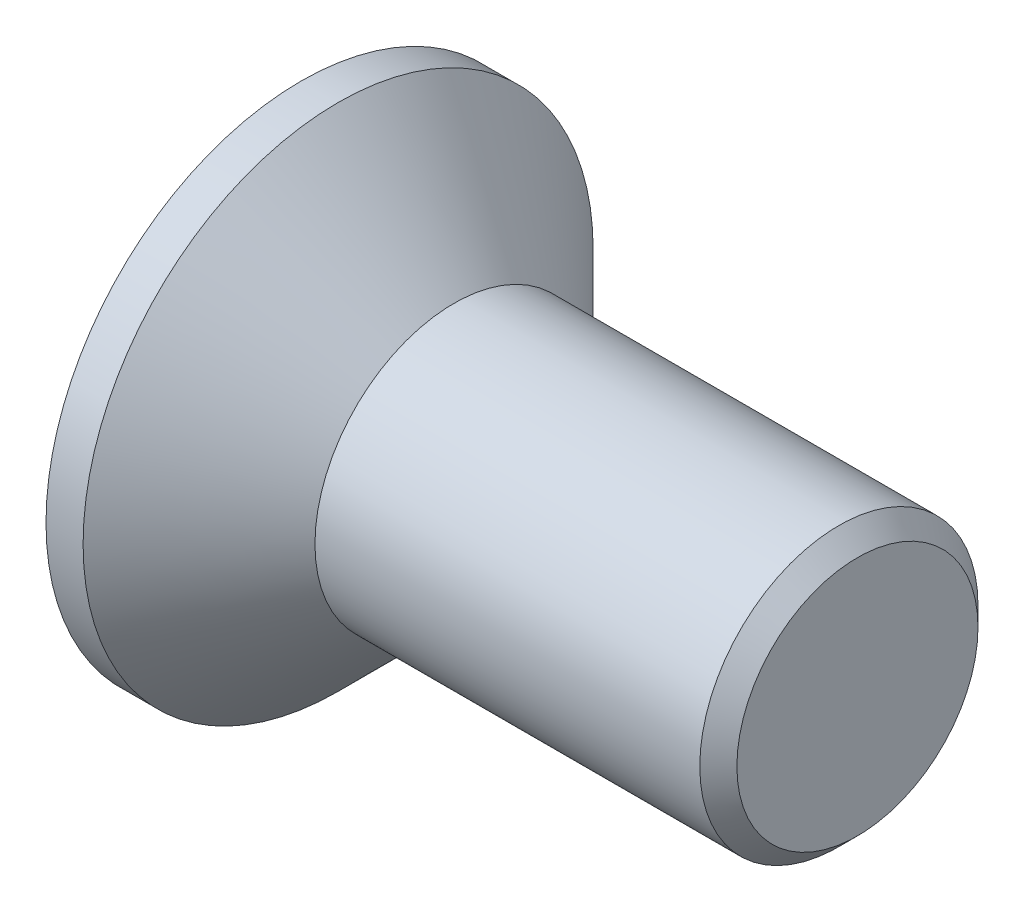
ISO-10303-21;
HEADER;
FILE_DESCRIPTION(('STEP AP214'),'2;1');
FILE_NAME('part.step','',(''),(''),'','','');
FILE_SCHEMA(('AUTOMOTIVE_DESIGN { 1 0 10303 214 1 1 1 1 }'));
ENDSEC;
DATA;
#1=APPLICATION_CONTEXT('core data for automotive mechanical design processes');
#2=APPLICATION_PROTOCOL_DEFINITION('international standard','automotive_design',2000,#1);
#3=PRODUCT_CONTEXT('',#1,'mechanical');
#4=PRODUCT('Part','Part','',(#3));
#5=PRODUCT_RELATED_PRODUCT_CATEGORY('part','',(#4));
#6=PRODUCT_DEFINITION_FORMATION('','',#4);
#7=PRODUCT_DEFINITION_CONTEXT('part definition',#1,'design');
#8=PRODUCT_DEFINITION('design','',#6,#7);
#9=PRODUCT_DEFINITION_SHAPE('','',#8);
#10=(LENGTH_UNIT() NAMED_UNIT(*) SI_UNIT(.MILLI.,.METRE.));
#11=(NAMED_UNIT(*) PLANE_ANGLE_UNIT() SI_UNIT($,.RADIAN.));
#12=(NAMED_UNIT(*) SI_UNIT($,.STERADIAN.) SOLID_ANGLE_UNIT());
#13=UNCERTAINTY_MEASURE_WITH_UNIT(LENGTH_MEASURE(1.E-05),#10,'distance_accuracy_value','');
#14=(GEOMETRIC_REPRESENTATION_CONTEXT(3) GLOBAL_UNCERTAINTY_ASSIGNED_CONTEXT((#13)) GLOBAL_UNIT_ASSIGNED_CONTEXT((#10,
#11,#12)) REPRESENTATION_CONTEXT('',''));
#15=CARTESIAN_POINT('',(0.,0.,0.));
#16=DIRECTION('',(0.,0.,1.));
#17=DIRECTION('',(1.,0.,0.));
#18=AXIS2_PLACEMENT_3D('',#15,#16,#17);
#19=CARTESIAN_POINT('',(0.,0.,0.));
#20=DIRECTION('',(-1.,0.,0.));
#21=DIRECTION('',(0.,0.,1.));
#22=AXIS2_PLACEMENT_3D('',#19,#20,#21);
#23=CONICAL_SURFACE('',#22,1.4,1.30899693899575);
#24=CARTESIAN_POINT('',(0.0494758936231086,1.184412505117,-0.272490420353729));
#25=CARTESIAN_POINT('',(0.0456763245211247,1.19979582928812,-0.268867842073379));
#26=CARTESIAN_POINT('',(0.0420142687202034,1.2148998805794,-0.263909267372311));
#27=CARTESIAN_POINT('',(0.0350324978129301,1.24412757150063,-0.251480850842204));
#28=CARTESIAN_POINT('',(0.0317128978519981,1.25825088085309,-0.244010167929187));
#29=CARTESIAN_POINT('',(0.0254826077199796,1.28509891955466,-0.226711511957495));
#30=CARTESIAN_POINT('',(0.0225723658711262,1.29782211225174,-0.216880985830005));
#31=CARTESIAN_POINT('',(0.0172248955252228,1.32144519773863,-0.195133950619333));
#32=CARTESIAN_POINT('',(0.0147873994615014,1.33234612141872,-0.183218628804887));
#33=CARTESIAN_POINT('',(0.0104748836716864,1.35178781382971,-0.157875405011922));
#34=CARTESIAN_POINT('',(0.00859002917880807,1.36036960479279,-0.144480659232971));
#35=CARTESIAN_POINT('',(0.00535872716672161,1.37516346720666,-0.116377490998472));
#36=CARTESIAN_POINT('',(0.00401233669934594,1.38137528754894,-0.101668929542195));
#37=CARTESIAN_POINT('',(0.00190884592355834,1.39111102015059,-0.0717048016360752));
#38=CARTESIAN_POINT('',(0.00113952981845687,1.39469061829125,-0.0564681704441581));
#39=CARTESIAN_POINT('',(0.000157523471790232,1.39926377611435,-0.0255960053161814));
#40=CARTESIAN_POINT('',(-5.52691749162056E-05,1.40025781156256,-0.00996054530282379));
#41=CARTESIAN_POINT('',(7.8867611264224E-05,1.39963210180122,0.0210654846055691));
#42=CARTESIAN_POINT('',(0.00041905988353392,1.39804381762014,0.0364567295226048));
#43=CARTESIAN_POINT('',(0.0016399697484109,1.39236385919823,0.0667488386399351));
#44=CARTESIAN_POINT('',(0.00252072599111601,1.38827200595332,0.0816496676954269));
#45=CARTESIAN_POINT('',(0.00480637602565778,1.37771350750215,0.110546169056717));
#46=CARTESIAN_POINT('',(0.0062114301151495,1.37124613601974,0.124541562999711));
#47=CARTESIAN_POINT('',(0.00951884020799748,1.35614044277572,0.15123791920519));
#48=CARTESIAN_POINT('',(0.0114211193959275,1.34750245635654,0.163939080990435));
#49=CARTESIAN_POINT('',(0.0157139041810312,1.32820010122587,0.187861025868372));
#50=CARTESIAN_POINT('',(0.0181100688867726,1.31751235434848,0.199061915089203));
#51=CARTESIAN_POINT('',(0.0233321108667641,1.2944967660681,0.219518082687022));
#52=CARTESIAN_POINT('',(0.0261582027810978,1.28216810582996,0.228772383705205));
#53=CARTESIAN_POINT('',(0.0322150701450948,1.25611050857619,0.245178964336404));
#54=CARTESIAN_POINT('',(0.0354493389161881,1.24236970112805,0.252311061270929));
#55=CARTESIAN_POINT('',(0.0422380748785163,1.21397728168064,0.26420997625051));
#56=CARTESIAN_POINT('',(0.0457924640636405,1.19932589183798,0.268977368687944));
#57=CARTESIAN_POINT('',(0.0494758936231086,1.184412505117,0.27249042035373));
#58=B_SPLINE_CURVE_WITH_KNOTS('',3,(#24,#25,#26,#27,#28,#29,#30,#31,#32,#33,#34,#35,#36,#37,#38,
#39,#40,#41,#42,#43,#44,#45,#46,#47,#48,#49,#50,#51,#52,#53,#54,#55,#56,#57),.UNSPECIFIED.,.F.,
.F.,(4,2,2,2,2,2,2,2,2,2,2,2,2,2,2,2,4),(0.,0.0487105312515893,0.0974373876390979,
0.146217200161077,0.194969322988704,0.242792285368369,0.290620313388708,0.337404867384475,
0.384180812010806,0.430391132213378,0.476604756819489,0.522832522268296,0.569053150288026,
0.615836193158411,0.662642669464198,0.709881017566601,0.757107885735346),.UNSPECIFIED.);
#59=CARTESIAN_POINT('',(0.,1.4,0.));
#60=VERTEX_POINT('',#59);
#61=CARTESIAN_POINT('',(0.049426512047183,1.18461250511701,0.272443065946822));
#62=VERTEX_POINT('',#61);
#63=EDGE_CURVE('E194',#60,#62,#58,.T.);
#64=ORIENTED_EDGE('',*,*,#63,.T.);
#65=CARTESIAN_POINT('',(0.0493771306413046,1.18481250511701,0.272395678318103));
#66=CARTESIAN_POINT('',(0.0558388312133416,1.15862135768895,0.27857608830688));
#67=CARTESIAN_POINT('',(0.0620203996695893,1.13286680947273,0.28696987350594));
#68=CARTESIAN_POINT('',(0.0735015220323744,1.08287223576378,0.307984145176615));
#69=CARTESIAN_POINT('',(0.0787992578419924,1.0586353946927,0.320613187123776));
#70=CARTESIAN_POINT('',(0.0881709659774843,1.01238532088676,0.349899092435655));
#71=CARTESIAN_POINT('',(0.0922425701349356,0.990376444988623,0.366563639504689));
#72=CARTESIAN_POINT('',(0.0988047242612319,0.949368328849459,0.403479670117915));
#73=CARTESIAN_POINT('',(0.101297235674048,0.930365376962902,0.423726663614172));
#74=CARTESIAN_POINT('',(0.104392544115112,0.896755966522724,0.466271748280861));
#75=CARTESIAN_POINT('',(0.105073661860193,0.881992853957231,0.488440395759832));
#76=CARTESIAN_POINT('',(0.104705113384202,0.856258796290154,0.534864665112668));
#77=CARTESIAN_POINT('',(0.103655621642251,0.845287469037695,0.559120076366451));
#78=CARTESIAN_POINT('',(0.0999930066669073,0.827738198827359,0.608131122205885));
#79=CARTESIAN_POINT('',(0.0974333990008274,0.821025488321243,0.632842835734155));
#80=CARTESIAN_POINT('',(0.0910050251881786,0.811530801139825,0.682858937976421));
#81=CARTESIAN_POINT('',(0.0871352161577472,0.808751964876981,0.708163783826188));
#82=CARTESIAN_POINT('',(0.0781256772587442,0.807082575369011,0.760035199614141));
#83=CARTESIAN_POINT('',(0.072930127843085,0.808402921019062,0.786598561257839));
#84=CARTESIAN_POINT('',(0.0617031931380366,0.815246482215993,0.838965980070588));
#85=CARTESIAN_POINT('',(0.055672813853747,0.820764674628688,0.864770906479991));
#86=CARTESIAN_POINT('',(0.0493763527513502,0.828308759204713,0.889882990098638));
#87=B_SPLINE_CURVE_WITH_KNOTS('',3,(#65,#66,#67,#68,#69,#70,#71,#72,#73,#74,#75,#76,#77,#78,#79,
#80,#81,#82,#83,#84,#85,#86),.UNSPECIFIED.,.F.,.F.,(4,2,2,2,2,2,2,2,2,2,4),(0.,
0.0829614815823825,0.166091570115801,0.249381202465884,0.33256717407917,0.412093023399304,
0.49161085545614,0.568466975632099,0.645384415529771,0.726323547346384,0.807165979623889),.UNSPECIFIED.);
#88=CARTESIAN_POINT('',(0.0494265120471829,0.828248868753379,0.889682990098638));
#89=VERTEX_POINT('',#88);
#90=EDGE_CURVE('E11',#62,#89,#87,.T.);
#91=ORIENTED_EDGE('',*,*,#90,.T.);
#92=CARTESIAN_POINT('',(0.0494766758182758,0.828188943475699,0.889482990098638));
#93=CARTESIAN_POINT('',(0.0456770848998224,0.832743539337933,0.904616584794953));
#94=CARTESIAN_POINT('',(0.0420150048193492,0.836001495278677,0.92017633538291));
#95=CARTESIAN_POINT('',(0.0350331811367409,0.839852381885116,0.951702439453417));
#96=CARTESIAN_POINT('',(0.0317135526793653,0.840444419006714,0.967668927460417));
#97=CARTESIAN_POINT('',(0.0254832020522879,0.838887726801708,0.999569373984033));
#98=CARTESIAN_POINT('',(0.0225729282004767,0.836736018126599,1.01550327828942));
#99=CARTESIAN_POINT('',(0.0172253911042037,0.829714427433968,1.04683508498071));
#100=CARTESIAN_POINT('',(0.0147878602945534,0.824846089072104,1.06223328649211));
#101=CARTESIAN_POINT('',(0.0104752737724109,0.812619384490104,1.09174205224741));
#102=CARTESIAN_POINT('',(0.00859038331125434,0.805310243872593,1.10587156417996));
#103=CARTESIAN_POINT('',(0.00535900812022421,0.788369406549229,1.13273521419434));
#104=CARTESIAN_POINT('',(0.00401258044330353,0.778737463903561,1.1454692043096));
#105=CARTESIAN_POINT('',(0.00190901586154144,0.757655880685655,1.16888290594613));
#106=CARTESIAN_POINT('',(0.00113966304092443,0.746250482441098,1.17960137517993));
#107=CARTESIAN_POINT('',(0.000157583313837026,0.721801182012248,1.19899820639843));
#108=CARTESIAN_POINT('',(-5.52460119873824E-05,0.708757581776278,1.207676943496));
#109=CARTESIAN_POINT('',(7.88185639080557E-05,0.681575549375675,1.22264837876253));
#110=CARTESIAN_POINT('',(0.000418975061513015,0.667452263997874,1.22896866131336));
#111=CARTESIAN_POINT('',(0.00163981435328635,0.638378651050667,1.23919604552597));
#112=CARTESIAN_POINT('',(0.00252053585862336,0.623428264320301,1.24310297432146));
#113=CARTESIAN_POINT('',(0.00480611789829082,0.593123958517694,1.24840762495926));
#114=CARTESIAN_POINT('',(0.0062111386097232,0.57776991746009,1.24980457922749));
#115=CARTESIAN_POINT('',(0.00951848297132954,0.547097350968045,1.25007117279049));
#116=CARTESIAN_POINT('',(0.0114207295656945,0.531778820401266,1.24894120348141));
#117=CARTESIAN_POINT('',(0.015713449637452,0.501410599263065,1.24418617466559));
#118=CARTESIAN_POINT('',(0.018109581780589,0.486366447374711,1.24053092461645));
#119=CARTESIAN_POINT('',(0.0233315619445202,0.457142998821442,1.2308272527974));
#120=CARTESIAN_POINT('',(0.0261576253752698,0.442964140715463,1.22477762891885));
#121=CARTESIAN_POINT('',(0.0322173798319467,0.415713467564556,1.21040769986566));
#122=CARTESIAN_POINT('',(0.0354549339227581,0.402654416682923,1.2020648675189));
#123=CARTESIAN_POINT('',(0.0422508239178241,0.378132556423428,1.18340416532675));
#124=CARTESIAN_POINT('',(0.0458090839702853,0.366669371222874,1.17308676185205));
#125=CARTESIAN_POINT('',(0.0494965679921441,0.356163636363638,1.16191390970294));
#126=B_SPLINE_CURVE_WITH_KNOTS('',3,(#92,#93,#94,#95,#96,#97,#98,#99,#100,#101,#102,#103,#104,
#105,#106,#107,#108,#109,#110,#111,#112,#113,#114,#115,#116,#117,#118,#119,#120,#121,#122,#123,
#124,#125),.UNSPECIFIED.,.F.,.F.,(4,2,2,2,2,2,2,2,2,2,2,2,2,2,2,2,4),(0.,0.0487105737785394,
0.097437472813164,0.146217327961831,0.194969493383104,0.242792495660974,0.290620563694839,
0.33740514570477,0.384181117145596,0.430391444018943,0.476605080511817,0.522832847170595,
0.56905345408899,0.615836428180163,0.662642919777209,0.709926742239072,0.757199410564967),.UNSPECIFIED.);
#127=CARTESIAN_POINT('',(0.,0.700000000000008,1.21243556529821));
#128=VERTEX_POINT('',#127);
#129=EDGE_CURVE('E62',#89,#128,#126,.T.);
#130=ORIENTED_EDGE('',*,*,#129,.T.);
#131=CARTESIAN_POINT('',(0.,0.,0.));
#132=DIRECTION('',(-1.,0.,0.));
#133=DIRECTION('',(0.,0.,1.));
#134=AXIS2_PLACEMENT_3D('',#131,#132,#133);
#135=CIRCLE('',#134,1.4);
#136=EDGE_CURVE('E268',#128,#60,#135,.T.);
#137=ORIENTED_EDGE('',*,*,#136,.T.);
#138=EDGE_LOOP('',(#64,#91,#130,#137));
#139=FACE_BOUND('',#138,.T.);
#140=ADVANCED_FACE('F34',(#139),#23,.F.);
#141=CARTESIAN_POINT('',(0.,-0.699999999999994,1.21243556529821));
#142=VERTEX_POINT('',#141);
#143=EDGE_CURVE('E283',#142,#128,#135,.T.);
#144=ORIENTED_EDGE('',*,*,#143,.T.);
#145=CARTESIAN_POINT('',(0.0494265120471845,0.356363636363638,1.16212605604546));
#146=VERTEX_POINT('',#145);
#147=EDGE_CURVE('E415',#128,#146,#126,.T.);
#148=ORIENTED_EDGE('',*,*,#147,.T.);
#149=CARTESIAN_POINT('',(0.0493604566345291,0.356552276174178,1.16232605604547));
#150=CARTESIAN_POINT('',(0.0558228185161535,0.338106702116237,1.14273104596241));
#151=CARTESIAN_POINT('',(0.0620051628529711,0.317962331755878,1.12462066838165));
#152=CARTESIAN_POINT('',(0.0734880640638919,0.274769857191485,1.09182462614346));
#153=CARTESIAN_POINT('',(0.0787868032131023,0.251715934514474,1.07714599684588));
#154=CARTESIAN_POINT('',(0.0881607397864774,0.203231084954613,1.05172818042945));
#155=CARTESIAN_POINT('',(0.0922335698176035,0.177795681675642,1.04099660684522));
#156=CARTESIAN_POINT('',(0.0987983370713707,0.12532262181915,1.02393329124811));
#157=CARTESIAN_POINT('',(0.101292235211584,0.0982869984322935,1.01759609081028));
#158=CARTESIAN_POINT('',(0.104390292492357,0.0446370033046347,1.00975496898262));
#159=CARTESIAN_POINT('',(0.10507277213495,0.0180564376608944,1.00805065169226));
#160=CARTESIAN_POINT('',(0.104706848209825,-0.0350165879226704,1.00896984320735));
#161=CARTESIAN_POINT('',(0.103658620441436,-0.0615090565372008,1.01159291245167));
#162=CARTESIAN_POINT('',(0.0999983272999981,-0.112730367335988,1.02089428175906));
#163=CARTESIAN_POINT('',(0.0974398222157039,-0.137488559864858,1.0274337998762));
#164=CARTESIAN_POINT('',(0.0910134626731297,-0.185553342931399,1.04421350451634));
#165=CARTESIAN_POINT('',(0.0871445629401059,-0.208858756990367,1.05445664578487));
#166=CARTESIAN_POINT('',(0.0781330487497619,-0.254636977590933,1.07895115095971));
#167=CARTESIAN_POINT('',(0.0729337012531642,-0.276999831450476,1.09338649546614));
#168=CARTESIAN_POINT('',(0.0616978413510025,-0.318962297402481,1.12552249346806));
#169=CARTESIAN_POINT('',(0.0556623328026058,-0.338565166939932,1.14321923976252));
#170=CARTESIAN_POINT('',(0.0493604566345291,-0.356552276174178,1.16232605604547));
#171=B_SPLINE_CURVE_WITH_KNOTS('',3,(#149,#150,#151,#152,#153,#154,#155,#156,#157,#158,#159,
#160,#161,#162,#163,#164,#165,#166,#167,#168,#169,#170),.UNSPECIFIED.,.F.,.F.,(4,2,2,2,2,2,2,2,
2,2,4),(0.,0.082963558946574,0.166095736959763,0.249387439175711,0.332575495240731,
0.412103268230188,0.491622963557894,0.56847897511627,0.645396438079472,0.726398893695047,
0.807304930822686),.UNSPECIFIED.);
#172=CARTESIAN_POINT('',(0.0494265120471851,-0.356363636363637,1.16212605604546));
#173=VERTEX_POINT('',#172);
#174=EDGE_CURVE('E47',#146,#173,#171,.T.);
#175=ORIENTED_EDGE('',*,*,#174,.T.);
#176=CARTESIAN_POINT('',(0.0494965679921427,-0.356163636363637,1.16191390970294));
#177=CARTESIAN_POINT('',(0.0456964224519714,-0.366989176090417,1.17342847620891));
#178=CARTESIAN_POINT('',(0.0420337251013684,-0.378832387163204,1.18403346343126));
#179=CARTESIAN_POINT('',(0.0350505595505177,-0.404204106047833,1.20313918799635));
#180=CARTESIAN_POINT('',(0.031730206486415,-0.417733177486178,1.21163921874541));
#181=CARTESIAN_POINT('',(0.0254983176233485,-0.446134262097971,1.2262497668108));
#182=CARTESIAN_POINT('',(0.0225872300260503,-0.46100771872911,1.23235767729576));
#183=CARTESIAN_POINT('',(0.0172379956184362,-0.491650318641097,1.24195167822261));
#184=CARTESIAN_POINT('',(0.0147995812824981,-0.5074189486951,1.24543925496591));
#185=CARTESIAN_POINT('',(0.0104851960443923,-0.539086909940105,1.2496141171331));
#186=CARTESIAN_POINT('',(0.00859939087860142,-0.554978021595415,1.25035350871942));
#187=CARTESIAN_POINT('',(0.00536615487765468,-0.586713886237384,1.24912311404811));
#188=CARTESIAN_POINT('',(0.00401878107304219,-0.602558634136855,1.24715304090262));
#189=CARTESIAN_POINT('',(0.00191334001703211,-0.633378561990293,1.24061126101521));
#190=CARTESIAN_POINT('',(0.00114305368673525,-0.648365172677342,1.2360972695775));
#191=CARTESIAN_POINT('',(0.000159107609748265,-0.677391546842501,1.22462990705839));
#192=CARTESIAN_POINT('',(-5.46545821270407E-05,-0.691431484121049,1.21767698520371));
#193=CARTESIAN_POINT('',(7.75737549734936E-05,-0.717992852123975,1.20162954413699));
#194=CARTESIAN_POINT('',(0.000416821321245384,-0.730530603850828,1.19256196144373));
#195=CARTESIAN_POINT('',(0.00163586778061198,-0.753930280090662,1.17250345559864));
#196=CARTESIAN_POINT('',(0.00251570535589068,-0.764792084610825,1.16151239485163));
#197=CARTESIAN_POINT('',(0.00479954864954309,-0.784544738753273,1.13792573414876));
#198=CARTESIAN_POINT('',(0.00620370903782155,-0.793435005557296,1.12532966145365));
#199=CARTESIAN_POINT('',(0.00950937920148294,-0.809009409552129,1.09890399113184));
#200=CARTESIAN_POINT('',(0.0114108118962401,-0.815693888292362,1.08507458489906));
#201=CARTESIAN_POINT('',(0.0157019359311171,-0.826767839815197,1.05640053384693));
#202=CARTESIAN_POINT('',(0.0180972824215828,-0.831128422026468,1.04154559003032));
#203=CARTESIAN_POINT('',(0.023317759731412,-0.837344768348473,1.01138741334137));
#204=CARTESIAN_POINT('',(0.0261431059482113,-0.839199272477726,0.996083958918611));
#205=CARTESIAN_POINT('',(0.0322013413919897,-0.840388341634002,0.96530056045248));
#206=CARTESIAN_POINT('',(0.0354380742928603,-0.839697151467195,0.949820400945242));
#207=CARTESIAN_POINT('',(0.0422323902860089,-0.835806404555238,0.91925420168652));
#208=CARTESIAN_POINT('',(0.0457898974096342,-0.832607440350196,0.904168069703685));
#209=CARTESIAN_POINT('',(0.0494766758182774,-0.828188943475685,0.889482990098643));
#210=B_SPLINE_CURVE_WITH_KNOTS('',3,(#176,#177,#178,#179,#180,#181,#182,#183,#184,#185,#186,
#187,#188,#189,#190,#191,#192,#193,#194,#195,#196,#197,#198,#199,#200,#201,#202,#203,#204,#205,
#206,#207,#208,#209),.UNSPECIFIED.,.F.,.F.,(4,2,2,2,2,2,2,2,2,2,2,2,2,2,2,2,4),(0.,
0.0487116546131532,0.0974396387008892,0.146220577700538,0.194973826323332,0.242797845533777,
0.290626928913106,0.33741220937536,0.384188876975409,0.430399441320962,0.476613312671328,
0.522840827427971,0.569061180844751,0.615843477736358,0.662649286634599,0.709929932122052,
0.757199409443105),.UNSPECIFIED.);
#211=EDGE_CURVE('E411',#173,#142,#210,.T.);
#212=ORIENTED_EDGE('',*,*,#211,.T.);
#213=EDGE_LOOP('',(#144,#148,#175,#212));
#214=FACE_BOUND('',#213,.T.);
#215=ADVANCED_FACE('F260',(#214),#23,.F.);
#216=CARTESIAN_POINT('',(0.,-1.4,0.));
#217=VERTEX_POINT('',#216);
#218=EDGE_CURVE('E414',#217,#142,#135,.T.);
#219=ORIENTED_EDGE('',*,*,#218,.T.);
#220=CARTESIAN_POINT('',(0.0494265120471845,-0.828248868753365,0.889682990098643));
#221=VERTEX_POINT('',#220);
#222=EDGE_CURVE('E356',#142,#221,#210,.T.);
#223=ORIENTED_EDGE('',*,*,#222,.T.);
#224=CARTESIAN_POINT('',(0.0493763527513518,-0.828308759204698,0.889882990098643));
#225=CARTESIAN_POINT('',(0.0558380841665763,-0.820565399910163,0.864110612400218));
#226=CARTESIAN_POINT('',(0.0620196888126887,-0.814957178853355,0.837609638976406));
#227=CARTESIAN_POINT('',(0.073500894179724,-0.808158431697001,0.783805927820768));
#228=CARTESIAN_POINT('',(0.0787986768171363,-0.806976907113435,0.756501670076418));
#229=CARTESIAN_POINT('',(0.0881704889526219,-0.809213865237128,0.701804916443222));
#230=CARTESIAN_POINT('',(0.09224215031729,-0.812641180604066,0.67441235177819));
#231=CARTESIAN_POINT('',(0.0988044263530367,-0.824107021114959,0.620440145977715));
#232=CARTESIAN_POINT('',(0.101297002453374,-0.832139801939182,0.593859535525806));
#233=CARTESIAN_POINT('',(0.104392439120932,-0.852179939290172,0.543480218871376));
#234=CARTESIAN_POINT('',(0.105073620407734,-0.863996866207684,0.519610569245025));
#235=CARTESIAN_POINT('',(0.104705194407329,-0.891334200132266,0.474111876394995));
#236=CARTESIAN_POINT('',(0.103655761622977,-0.906854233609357,0.452482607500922));
#237=CARTESIAN_POINT('',(0.0999932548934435,-0.940524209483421,0.412778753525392));
#238=CARTESIAN_POINT('',(0.0974336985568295,-0.958568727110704,0.394609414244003));
#239=CARTESIAN_POINT('',(0.0910054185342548,-0.997136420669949,0.361378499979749));
#240=CARTESIAN_POINT('',(0.0871356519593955,-1.01766156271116,0.346319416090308));
#241=CARTESIAN_POINT('',(0.0781262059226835,-1.06174861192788,0.318937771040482));
#242=CARTESIAN_POINT('',(0.0729307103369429,-1.08541318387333,0.306799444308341));
#243=CARTESIAN_POINT('',(0.0617038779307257,-1.13418619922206,0.286542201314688));
#244=CARTESIAN_POINT('',(0.0556735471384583,-1.15929288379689,0.278418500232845));
#245=CARTESIAN_POINT('',(0.0493771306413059,-1.18481250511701,0.272395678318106));
#246=B_SPLINE_CURVE_WITH_KNOTS('',3,(#224,#225,#226,#227,#228,#229,#230,#231,#232,#233,#234,
#235,#236,#237,#238,#239,#240,#241,#242,#243,#244,#245),.UNSPECIFIED.,.F.,.F.,(4,2,2,2,2,2,2,2,
2,2,4),(0.,0.0829615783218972,0.166091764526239,0.249381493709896,0.332567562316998,
0.412093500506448,0.491611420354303,0.568467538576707,0.645384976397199,0.726323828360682,
0.807165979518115),.UNSPECIFIED.);
#247=CARTESIAN_POINT('',(0.049426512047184,-1.18461250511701,0.272443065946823));
#248=VERTEX_POINT('',#247);
#249=EDGE_CURVE('E382',#221,#248,#246,.T.);
#250=ORIENTED_EDGE('',*,*,#249,.T.);
#251=CARTESIAN_POINT('',(0.0494758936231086,-1.184412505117,0.272490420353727));
#252=CARTESIAN_POINT('',(0.0456763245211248,-1.19979582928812,0.268867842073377));
#253=CARTESIAN_POINT('',(0.0420142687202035,-1.2148998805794,0.26390926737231));
#254=CARTESIAN_POINT('',(0.0350324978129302,-1.24412757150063,0.251480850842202));
#255=CARTESIAN_POINT('',(0.0317128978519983,-1.25825088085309,0.244010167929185));
#256=CARTESIAN_POINT('',(0.0254826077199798,-1.28509891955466,0.226711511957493));
#257=CARTESIAN_POINT('',(0.0225723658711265,-1.29782211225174,0.216880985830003));
#258=CARTESIAN_POINT('',(0.0172248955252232,-1.32144519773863,0.195133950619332));
#259=CARTESIAN_POINT('',(0.0147873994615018,-1.33234612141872,0.183218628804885));
#260=CARTESIAN_POINT('',(0.0104748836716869,-1.35178781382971,0.15787540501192));
#261=CARTESIAN_POINT('',(0.00859002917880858,-1.36036960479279,0.144480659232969));
#262=CARTESIAN_POINT('',(0.0053587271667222,-1.37516346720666,0.116377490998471));
#263=CARTESIAN_POINT('',(0.00401233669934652,-1.38137528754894,0.101668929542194));
#264=CARTESIAN_POINT('',(0.00190884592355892,-1.39111102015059,0.0717048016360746));
#265=CARTESIAN_POINT('',(0.00113952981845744,-1.39469061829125,0.0564681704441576));
#266=CARTESIAN_POINT('',(0.000157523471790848,-1.39926377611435,0.0255960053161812));
#267=CARTESIAN_POINT('',(-5.5269174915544E-05,-1.40025781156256,0.0099605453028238));
#268=CARTESIAN_POINT('',(7.88676112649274E-05,-1.39963210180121,-0.0210654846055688));
#269=CARTESIAN_POINT('',(0.00041905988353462,-1.39804381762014,-0.0364567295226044));
#270=CARTESIAN_POINT('',(0.00163996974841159,-1.39236385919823,-0.0667488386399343));
#271=CARTESIAN_POINT('',(0.0025207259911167,-1.38827200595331,-0.081649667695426));
#272=CARTESIAN_POINT('',(0.00480637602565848,-1.37771350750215,-0.110546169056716));
#273=CARTESIAN_POINT('',(0.00621143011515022,-1.37124613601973,-0.12454156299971));
#274=CARTESIAN_POINT('',(0.0095188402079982,-1.35614044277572,-0.151237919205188));
#275=CARTESIAN_POINT('',(0.0114211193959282,-1.34750245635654,-0.163939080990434));
#276=CARTESIAN_POINT('',(0.0157139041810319,-1.32820010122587,-0.18786102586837));
#277=CARTESIAN_POINT('',(0.0181100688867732,-1.31751235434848,-0.199061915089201));
#278=CARTESIAN_POINT('',(0.0233321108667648,-1.29449676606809,-0.21951808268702));
#279=CARTESIAN_POINT('',(0.0261582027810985,-1.28216810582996,-0.228772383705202));
#280=CARTESIAN_POINT('',(0.0322150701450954,-1.25611050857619,-0.245178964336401));
#281=CARTESIAN_POINT('',(0.0354493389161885,-1.24236970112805,-0.252311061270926));
#282=CARTESIAN_POINT('',(0.0422380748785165,-1.21397728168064,-0.264209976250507));
#283=CARTESIAN_POINT('',(0.0457924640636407,-1.19932589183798,-0.26897736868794));
#284=CARTESIAN_POINT('',(0.0494758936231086,-1.184412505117,-0.272490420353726));
#285=B_SPLINE_CURVE_WITH_KNOTS('',3,(#251,#252,#253,#254,#255,#256,#257,#258,#259,#260,#261,
#262,#263,#264,#265,#266,#267,#268,#269,#270,#271,#272,#273,#274,#275,#276,#277,#278,#279,#280,
#281,#282,#283,#284),.UNSPECIFIED.,.F.,.F.,(4,2,2,2,2,2,2,2,2,2,2,2,2,2,2,2,4),(0.,
0.0487105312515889,0.0974373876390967,0.146217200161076,0.194969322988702,0.242792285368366,
0.290620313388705,0.337404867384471,0.384180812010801,0.430391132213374,0.476604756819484,
0.52283252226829,0.56905315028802,0.615836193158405,0.662642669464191,0.709881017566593,
0.757107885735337),.UNSPECIFIED.);
#286=EDGE_CURVE('E355',#248,#217,#285,.T.);
#287=ORIENTED_EDGE('',*,*,#286,.T.);
#288=EDGE_LOOP('',(#219,#223,#250,#287));
#289=FACE_BOUND('',#288,.T.);
#290=ADVANCED_FACE('F265',(#289),#23,.F.);
#291=CARTESIAN_POINT('',(0.,-0.700000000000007,-1.21243556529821));
#292=VERTEX_POINT('',#291);
#293=EDGE_CURVE('E284',#292,#217,#135,.T.);
#294=ORIENTED_EDGE('',*,*,#293,.T.);
#295=CARTESIAN_POINT('',(0.0494265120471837,-1.18461250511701,-0.272443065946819));
#296=VERTEX_POINT('',#295);
#297=EDGE_CURVE('E344',#217,#296,#285,.T.);
#298=ORIENTED_EDGE('',*,*,#297,.T.);
#299=CARTESIAN_POINT('',(0.0493771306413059,-1.18481250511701,-0.272395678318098));
#300=CARTESIAN_POINT('',(0.055838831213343,-1.15862135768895,-0.278576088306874));
#301=CARTESIAN_POINT('',(0.0620203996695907,-1.13286680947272,-0.286969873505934));
#302=CARTESIAN_POINT('',(0.0735015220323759,-1.08287223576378,-0.307984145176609));
#303=CARTESIAN_POINT('',(0.078799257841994,-1.05863539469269,-0.32061318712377));
#304=CARTESIAN_POINT('',(0.0881709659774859,-1.01238532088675,-0.349899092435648));
#305=CARTESIAN_POINT('',(0.0922425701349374,-0.990376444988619,-0.366563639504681));
#306=CARTESIAN_POINT('',(0.098804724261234,-0.949368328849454,-0.403479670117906));
#307=CARTESIAN_POINT('',(0.10129723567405,-0.930365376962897,-0.423726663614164));
#308=CARTESIAN_POINT('',(0.104392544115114,-0.896755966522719,-0.466271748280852));
#309=CARTESIAN_POINT('',(0.105073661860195,-0.881992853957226,-0.488440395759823));
#310=CARTESIAN_POINT('',(0.104705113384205,-0.856258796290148,-0.534864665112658));
#311=CARTESIAN_POINT('',(0.103655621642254,-0.845287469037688,-0.55912007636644));
#312=CARTESIAN_POINT('',(0.0999930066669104,-0.827738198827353,-0.608131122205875));
#313=CARTESIAN_POINT('',(0.0974333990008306,-0.821025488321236,-0.632842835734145));
#314=CARTESIAN_POINT('',(0.091005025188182,-0.811530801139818,-0.68285893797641));
#315=CARTESIAN_POINT('',(0.0871352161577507,-0.808751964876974,-0.708163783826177));
#316=CARTESIAN_POINT('',(0.0781256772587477,-0.807082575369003,-0.760035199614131));
#317=CARTESIAN_POINT('',(0.0729301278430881,-0.808402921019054,-0.78659856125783));
#318=CARTESIAN_POINT('',(0.0617031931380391,-0.815246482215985,-0.838965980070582));
#319=CARTESIAN_POINT('',(0.0556728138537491,-0.820764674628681,-0.864770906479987));
#320=CARTESIAN_POINT('',(0.049376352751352,-0.828308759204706,-0.889882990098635));
#321=B_SPLINE_CURVE_WITH_KNOTS('',3,(#299,#300,#301,#302,#303,#304,#305,#306,#307,#308,#309,
#310,#311,#312,#313,#314,#315,#316,#317,#318,#319,#320),.UNSPECIFIED.,.F.,.F.,(4,2,2,2,2,2,2,2,
2,2,4),(0.,0.0829614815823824,0.166091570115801,0.249381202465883,0.332567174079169,
0.412093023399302,0.491610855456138,0.568466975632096,0.645384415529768,0.726323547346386,
0.807165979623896),.UNSPECIFIED.);
#322=CARTESIAN_POINT('',(0.0494265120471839,-0.828248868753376,-0.889682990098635));
#323=VERTEX_POINT('',#322);
#324=EDGE_CURVE('E311',#296,#323,#321,.T.);
#325=ORIENTED_EDGE('',*,*,#324,.T.);
#326=CARTESIAN_POINT('',(0.0494766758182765,-0.828188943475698,-0.889482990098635));
#327=CARTESIAN_POINT('',(0.0456770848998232,-0.832743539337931,-0.904616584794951));
#328=CARTESIAN_POINT('',(0.04201500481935,-0.836001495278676,-0.920176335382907));
#329=CARTESIAN_POINT('',(0.0350331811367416,-0.839852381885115,-0.951702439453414));
#330=CARTESIAN_POINT('',(0.031713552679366,-0.840444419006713,-0.967668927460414));
#331=CARTESIAN_POINT('',(0.0254832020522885,-0.838887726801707,-0.99956937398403));
#332=CARTESIAN_POINT('',(0.0225729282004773,-0.836736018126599,-1.01550327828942));
#333=CARTESIAN_POINT('',(0.0172253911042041,-0.829714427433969,-1.04683508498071));
#334=CARTESIAN_POINT('',(0.0147878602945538,-0.824846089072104,-1.06223328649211));
#335=CARTESIAN_POINT('',(0.0104752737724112,-0.812619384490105,-1.09174205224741));
#336=CARTESIAN_POINT('',(0.00859038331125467,-0.805310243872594,-1.10587156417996));
#337=CARTESIAN_POINT('',(0.00535900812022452,-0.78836940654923,-1.13273521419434));
#338=CARTESIAN_POINT('',(0.00401258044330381,-0.778737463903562,-1.1454692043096));
#339=CARTESIAN_POINT('',(0.0019090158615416,-0.757655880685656,-1.16888290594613));
#340=CARTESIAN_POINT('',(0.00113966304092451,-0.7462504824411,-1.17960137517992));
#341=CARTESIAN_POINT('',(0.000157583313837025,-0.72180118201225,-1.19899820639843));
#342=CARTESIAN_POINT('',(-5.52460119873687E-05,-0.70875758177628,-1.207676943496));
#343=CARTESIAN_POINT('',(7.88185639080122E-05,-0.681575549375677,-1.22264837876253));
#344=CARTESIAN_POINT('',(0.000418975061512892,-0.667452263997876,-1.22896866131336));
#345=CARTESIAN_POINT('',(0.00163981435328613,-0.638378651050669,-1.23919604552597));
#346=CARTESIAN_POINT('',(0.00252053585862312,-0.623428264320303,-1.24310297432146));
#347=CARTESIAN_POINT('',(0.00480611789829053,-0.593123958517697,-1.24840762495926));
#348=CARTESIAN_POINT('',(0.0062111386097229,-0.577769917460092,-1.24980457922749));
#349=CARTESIAN_POINT('',(0.00951848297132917,-0.547097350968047,-1.25007117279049));
#350=CARTESIAN_POINT('',(0.0114207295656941,-0.531778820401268,-1.24894120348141));
#351=CARTESIAN_POINT('',(0.0157134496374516,-0.501410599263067,-1.24418617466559));
#352=CARTESIAN_POINT('',(0.0181095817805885,-0.486366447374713,-1.24053092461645));
#353=CARTESIAN_POINT('',(0.0233315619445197,-0.457142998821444,-1.23082725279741));
#354=CARTESIAN_POINT('',(0.0261576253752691,-0.442964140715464,-1.22477762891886));
#355=CARTESIAN_POINT('',(0.032217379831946,-0.415713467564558,-1.21040769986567));
#356=CARTESIAN_POINT('',(0.0354549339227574,-0.402654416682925,-1.2020648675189));
#357=CARTESIAN_POINT('',(0.0422508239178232,-0.378132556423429,-1.18340416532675));
#358=CARTESIAN_POINT('',(0.0458090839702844,-0.366669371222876,-1.17308676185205));
#359=CARTESIAN_POINT('',(0.049496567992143,-0.35616363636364,-1.16191390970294));
#360=B_SPLINE_CURVE_WITH_KNOTS('',3,(#326,#327,#328,#329,#330,#331,#332,#333,#334,#335,#336,
#337,#338,#339,#340,#341,#342,#343,#344,#345,#346,#347,#348,#349,#350,#351,#352,#353,#354,#355,
#356,#357,#358,#359),.UNSPECIFIED.,.F.,.F.,(4,2,2,2,2,2,2,2,2,2,2,2,2,2,2,2,4),(0.,
0.0487105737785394,0.0974374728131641,0.146217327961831,0.194969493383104,0.242792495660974,
0.29062056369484,0.33740514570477,0.384181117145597,0.430391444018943,0.476605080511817,
0.522832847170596,0.569053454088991,0.615836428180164,0.66264291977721,0.709926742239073,
0.757199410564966),.UNSPECIFIED.);
#361=EDGE_CURVE('E342',#323,#292,#360,.T.);
#362=ORIENTED_EDGE('',*,*,#361,.T.);
#363=EDGE_LOOP('',(#294,#298,#325,#362));
#364=FACE_BOUND('',#363,.T.);
#365=ADVANCED_FACE('F381',(#364),#23,.F.);
#366=CARTESIAN_POINT('',(0.,0.699999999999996,-1.21243556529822));
#367=VERTEX_POINT('',#366);
#368=EDGE_CURVE('E280',#367,#292,#135,.T.);
#369=ORIENTED_EDGE('',*,*,#368,.T.);
#370=CARTESIAN_POINT('',(0.0494265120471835,-0.35636363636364,-1.16212605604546));
#371=VERTEX_POINT('',#370);
#372=EDGE_CURVE('E339',#292,#371,#360,.T.);
#373=ORIENTED_EDGE('',*,*,#372,.T.);
#374=CARTESIAN_POINT('',(0.049360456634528,-0.356552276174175,-1.16232605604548));
#375=CARTESIAN_POINT('',(0.0558228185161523,-0.338106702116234,-1.14273104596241));
#376=CARTESIAN_POINT('',(0.0620051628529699,-0.317962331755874,-1.12462066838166));
#377=CARTESIAN_POINT('',(0.0734880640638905,-0.27476985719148,-1.09182462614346));
#378=CARTESIAN_POINT('',(0.0787868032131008,-0.251715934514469,-1.07714599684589));
#379=CARTESIAN_POINT('',(0.0881607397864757,-0.203231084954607,-1.05172818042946));
#380=CARTESIAN_POINT('',(0.0922335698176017,-0.177795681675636,-1.04099660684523));
#381=CARTESIAN_POINT('',(0.0987983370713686,-0.125322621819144,-1.02393329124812));
#382=CARTESIAN_POINT('',(0.101292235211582,-0.0982869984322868,-1.01759609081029));
#383=CARTESIAN_POINT('',(0.104390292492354,-0.0446370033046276,-1.00975496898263));
#384=CARTESIAN_POINT('',(0.105072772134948,-0.0180564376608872,-1.00805065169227));
#385=CARTESIAN_POINT('',(0.104706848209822,0.0350165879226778,-1.00896984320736));
#386=CARTESIAN_POINT('',(0.103658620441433,0.0615090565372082,-1.01159291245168));
#387=CARTESIAN_POINT('',(0.0999983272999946,0.112730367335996,-1.02089428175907));
#388=CARTESIAN_POINT('',(0.0974398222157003,0.137488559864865,-1.02743379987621));
#389=CARTESIAN_POINT('',(0.0910134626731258,0.185553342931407,-1.04421350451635));
#390=CARTESIAN_POINT('',(0.0871445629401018,0.208858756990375,-1.05445664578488));
#391=CARTESIAN_POINT('',(0.078133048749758,0.254636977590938,-1.07895115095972));
#392=CARTESIAN_POINT('',(0.0729337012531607,0.27699983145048,-1.09338649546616));
#393=CARTESIAN_POINT('',(0.0616978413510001,0.31896229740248,-1.12552249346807));
#394=CARTESIAN_POINT('',(0.055662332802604,0.33856516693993,-1.14321923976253));
#395=CARTESIAN_POINT('',(0.0493604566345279,0.356552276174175,-1.16232605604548));
#396=B_SPLINE_CURVE_WITH_KNOTS('',3,(#374,#375,#376,#377,#378,#379,#380,#381,#382,#383,#384,
#385,#386,#387,#388,#389,#390,#391,#392,#393,#394,#395),.UNSPECIFIED.,.F.,.F.,(4,2,2,2,2,2,2,2,
2,2,4),(0.,0.0829635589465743,0.166095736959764,0.249387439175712,0.332575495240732,
0.41210326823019,0.491622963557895,0.568478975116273,0.645396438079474,0.726398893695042,
0.807304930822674),.UNSPECIFIED.);
#397=CARTESIAN_POINT('',(0.0494265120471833,0.356363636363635,-1.16212605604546));
#398=VERTEX_POINT('',#397);
#399=EDGE_CURVE('E304',#371,#398,#396,.T.);
#400=ORIENTED_EDGE('',*,*,#399,.T.);
#401=CARTESIAN_POINT('',(0.0494965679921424,0.356163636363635,-1.16191390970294));
#402=CARTESIAN_POINT('',(0.045696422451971,0.366989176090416,-1.17342847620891));
#403=CARTESIAN_POINT('',(0.042033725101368,0.378832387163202,-1.18403346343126));
#404=CARTESIAN_POINT('',(0.0350505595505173,0.404204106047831,-1.20313918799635));
#405=CARTESIAN_POINT('',(0.0317302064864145,0.417733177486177,-1.21163921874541));
#406=CARTESIAN_POINT('',(0.025498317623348,0.44613426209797,-1.2262497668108));
#407=CARTESIAN_POINT('',(0.0225872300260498,0.461007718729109,-1.23235767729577));
#408=CARTESIAN_POINT('',(0.0172379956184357,0.491650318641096,-1.24195167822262));
#409=CARTESIAN_POINT('',(0.0147995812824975,0.507418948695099,-1.24543925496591));
#410=CARTESIAN_POINT('',(0.0104851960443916,0.539086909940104,-1.2496141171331));
#411=CARTESIAN_POINT('',(0.00859939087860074,0.554978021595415,-1.25035350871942));
#412=CARTESIAN_POINT('',(0.00536615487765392,0.586713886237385,-1.24912311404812));
#413=CARTESIAN_POINT('',(0.00401878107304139,0.602558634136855,-1.24715304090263));
#414=CARTESIAN_POINT('',(0.00191334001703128,0.633378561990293,-1.24061126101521));
#415=CARTESIAN_POINT('',(0.00114305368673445,0.648365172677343,-1.2360972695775));
#416=CARTESIAN_POINT('',(0.000159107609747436,0.677391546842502,-1.22462990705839));
#417=CARTESIAN_POINT('',(-5.46545821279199E-05,0.69143148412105,-1.21767698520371));
#418=CARTESIAN_POINT('',(7.75737549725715E-05,0.717992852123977,-1.20162954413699));
#419=CARTESIAN_POINT('',(0.000416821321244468,0.730530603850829,-1.19256196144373));
#420=CARTESIAN_POINT('',(0.0016358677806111,0.753930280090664,-1.17250345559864));
#421=CARTESIAN_POINT('',(0.00251570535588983,0.764792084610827,-1.16151239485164));
#422=CARTESIAN_POINT('',(0.00479954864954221,0.784544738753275,-1.13792573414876));
#423=CARTESIAN_POINT('',(0.00620370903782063,0.793435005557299,-1.12532966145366));
#424=CARTESIAN_POINT('',(0.00950937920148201,0.809009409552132,-1.09890399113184));
#425=CARTESIAN_POINT('',(0.0114108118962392,0.815693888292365,-1.08507458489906));
#426=CARTESIAN_POINT('',(0.0157019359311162,0.8267678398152,-1.05640053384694));
#427=CARTESIAN_POINT('',(0.018097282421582,0.831128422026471,-1.04154559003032));
#428=CARTESIAN_POINT('',(0.0233177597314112,0.837344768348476,-1.01138741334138));
#429=CARTESIAN_POINT('',(0.0261431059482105,0.839199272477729,-0.996083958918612));
#430=CARTESIAN_POINT('',(0.032201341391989,0.840388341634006,-0.965300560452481));
#431=CARTESIAN_POINT('',(0.0354380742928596,0.839697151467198,-0.949820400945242));
#432=CARTESIAN_POINT('',(0.0422323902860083,0.835806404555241,-0.91925420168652));
#433=CARTESIAN_POINT('',(0.0457898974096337,0.832607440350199,-0.904168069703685));
#434=CARTESIAN_POINT('',(0.0494766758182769,0.828188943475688,-0.889482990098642));
#435=B_SPLINE_CURVE_WITH_KNOTS('',3,(#401,#402,#403,#404,#405,#406,#407,#408,#409,#410,#411,
#412,#413,#414,#415,#416,#417,#418,#419,#420,#421,#422,#423,#424,#425,#426,#427,#428,#429,#430,
#431,#432,#433,#434),.UNSPECIFIED.,.F.,.F.,(4,2,2,2,2,2,2,2,2,2,2,2,2,2,2,2,4),(0.,
0.0487116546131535,0.09743963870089,0.146220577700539,0.194973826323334,0.242797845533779,
0.290626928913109,0.337412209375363,0.384188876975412,0.430399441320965,0.476613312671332,
0.522840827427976,0.569061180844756,0.615843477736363,0.662649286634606,0.709929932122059,
0.757199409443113),.UNSPECIFIED.);
#436=EDGE_CURVE('E336',#398,#367,#435,.T.);
#437=ORIENTED_EDGE('',*,*,#436,.T.);
#438=EDGE_LOOP('',(#369,#373,#400,#437));
#439=FACE_BOUND('',#438,.T.);
#440=ADVANCED_FACE('F256',(#439),#23,.F.);
#441=CARTESIAN_POINT('',(0.,0.,0.));
#442=DIRECTION('',(-1.,0.,0.));
#443=DIRECTION('',(0.,0.,1.));
#444=AXIS2_PLACEMENT_3D('',#441,#442,#443);
#445=CYLINDRICAL_SURFACE('',#444,2.75);
#446=CARTESIAN_POINT('',(0.,0.,0.));
#447=DIRECTION('',(-1.,0.,0.));
#448=DIRECTION('',(0.,0.,1.));
#449=AXIS2_PLACEMENT_3D('',#446,#447,#448);
#450=CIRCLE('',#449,2.75);
#451=CARTESIAN_POINT('',(0.,0.,2.75));
#452=VERTEX_POINT('',#451);
#453=EDGE_CURVE('E287',#452,#452,#450,.T.);
#454=ORIENTED_EDGE('',*,*,#453,.F.);
#455=EDGE_LOOP('',(#454));
#456=FACE_BOUND('',#455,.T.);
#457=CARTESIAN_POINT('',(0.399999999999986,0.,0.));
#458=DIRECTION('',(-1.,0.,0.));
#459=DIRECTION('',(0.,0.,1.));
#460=AXIS2_PLACEMENT_3D('',#457,#458,#459);
#461=CIRCLE('',#460,2.75);
#462=CARTESIAN_POINT('',(0.399999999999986,0.,2.75));
#463=VERTEX_POINT('',#462);
#464=EDGE_CURVE('E297',#463,#463,#461,.T.);
#465=ORIENTED_EDGE('',*,*,#464,.T.);
#466=EDGE_LOOP('',(#465));
#467=FACE_BOUND('',#466,.T.);
#468=ADVANCED_FACE('F36',(#456,#467),#445,.T.);
#469=CARTESIAN_POINT('',(1.65,0.,0.));
#470=DIRECTION('',(-1.,0.,0.));
#471=DIRECTION('',(0.,0.,1.));
#472=AXIS2_PLACEMENT_3D('',#469,#470,#471);
#473=CONICAL_SURFACE('',#472,1.5,0.785398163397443);
#474=ORIENTED_EDGE('',*,*,#464,.F.);
#475=EDGE_LOOP('',(#474));
#476=FACE_BOUND('',#475,.T.);
#477=CARTESIAN_POINT('',(1.65,0.,0.));
#478=DIRECTION('',(-1.,0.,0.));
#479=DIRECTION('',(0.,0.,1.));
#480=AXIS2_PLACEMENT_3D('',#477,#478,#479);
#481=CIRCLE('',#480,1.5);
#482=CARTESIAN_POINT('',(1.65,0.,1.5));
#483=VERTEX_POINT('',#482);
#484=EDGE_CURVE('E294',#483,#483,#481,.T.);
#485=ORIENTED_EDGE('',*,*,#484,.T.);
#486=EDGE_LOOP('',(#485));
#487=FACE_BOUND('',#486,.T.);
#488=ADVANCED_FACE('F426',(#476,#487),#473,.T.);
#489=CARTESIAN_POINT('',(0.,0.,0.));
#490=DIRECTION('',(-1.,0.,0.));
#491=DIRECTION('',(0.,0.,1.));
#492=AXIS2_PLACEMENT_3D('',#489,#490,#491);
#493=CYLINDRICAL_SURFACE('',#492,1.5);
#494=ORIENTED_EDGE('',*,*,#484,.F.);
#495=EDGE_LOOP('',(#494));
#496=FACE_BOUND('',#495,.T.);
#497=CARTESIAN_POINT('',(5.8,0.,0.));
#498=DIRECTION('',(-1.,0.,0.));
#499=DIRECTION('',(0.,0.,1.));
#500=AXIS2_PLACEMENT_3D('',#497,#498,#499);
#501=CIRCLE('',#500,1.5);
#502=CARTESIAN_POINT('',(5.8,0.,1.5));
#503=VERTEX_POINT('',#502);
#504=EDGE_CURVE('E291',#503,#503,#501,.T.);
#505=ORIENTED_EDGE('',*,*,#504,.T.);
#506=EDGE_LOOP('',(#505));
#507=FACE_BOUND('',#506,.T.);
#508=ADVANCED_FACE('F431',(#496,#507),#493,.T.);
#509=CARTESIAN_POINT('',(6.,0.,0.));
#510=DIRECTION('',(-1.,0.,0.));
#511=DIRECTION('',(0.,0.,1.));
#512=AXIS2_PLACEMENT_3D('',#509,#510,#511);
#513=CONICAL_SURFACE('',#512,1.3,0.785398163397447);
#514=ORIENTED_EDGE('',*,*,#504,.F.);
#515=EDGE_LOOP('',(#514));
#516=FACE_BOUND('',#515,.T.);
#517=CARTESIAN_POINT('',(6.,0.,0.));
#518=DIRECTION('',(-1.,0.,0.));
#519=DIRECTION('',(0.,0.,1.));
#520=AXIS2_PLACEMENT_3D('',#517,#518,#519);
#521=CIRCLE('',#520,1.3);
#522=CARTESIAN_POINT('',(6.,0.,1.3));
#523=VERTEX_POINT('',#522);
#524=EDGE_CURVE('E282',#523,#523,#521,.T.);
#525=ORIENTED_EDGE('',*,*,#524,.T.);
#526=EDGE_LOOP('',(#525));
#527=FACE_BOUND('',#526,.T.);
#528=ADVANCED_FACE('F436',(#516,#527),#513,.T.);
#529=CARTESIAN_POINT('',(6.,1.3,0.));
#530=DIRECTION('',(-1.,0.,0.));
#531=DIRECTION('',(0.,0.,1.));
#532=AXIS2_PLACEMENT_3D('',#529,#530,#531);
#533=PLANE('',#532);
#534=ORIENTED_EDGE('',*,*,#524,.F.);
#535=EDGE_LOOP('',(#534));
#536=FACE_BOUND('',#535,.T.);
#537=ADVANCED_FACE('F254',(#536),#533,.F.);
#538=EDGE_CURVE('E274',#60,#367,#135,.T.);
#539=ORIENTED_EDGE('',*,*,#538,.T.);
#540=CARTESIAN_POINT('',(0.0494265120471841,0.828248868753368,-0.889682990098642));
#541=VERTEX_POINT('',#540);
#542=EDGE_CURVE('E229',#367,#541,#435,.T.);
#543=ORIENTED_EDGE('',*,*,#542,.T.);
#544=CARTESIAN_POINT('',(0.0493763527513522,0.828308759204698,-0.889882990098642));
#545=CARTESIAN_POINT('',(0.0558380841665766,0.820565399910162,-0.864110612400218));
#546=CARTESIAN_POINT('',(0.062019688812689,0.814957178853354,-0.837609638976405));
#547=CARTESIAN_POINT('',(0.0735008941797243,0.808158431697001,-0.783805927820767));
#548=CARTESIAN_POINT('',(0.0787986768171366,0.806976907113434,-0.756501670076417));
#549=CARTESIAN_POINT('',(0.0881704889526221,0.809213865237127,-0.701804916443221));
#550=CARTESIAN_POINT('',(0.0922421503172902,0.812641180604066,-0.674412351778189));
#551=CARTESIAN_POINT('',(0.0988044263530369,0.824107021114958,-0.620440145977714));
#552=CARTESIAN_POINT('',(0.101297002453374,0.832139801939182,-0.593859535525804));
#553=CARTESIAN_POINT('',(0.104392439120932,0.852179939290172,-0.543480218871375));
#554=CARTESIAN_POINT('',(0.105073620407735,0.863996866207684,-0.519610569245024));
#555=CARTESIAN_POINT('',(0.104705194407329,0.891334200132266,-0.474111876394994));
#556=CARTESIAN_POINT('',(0.103655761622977,0.906854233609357,-0.452482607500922));
#557=CARTESIAN_POINT('',(0.0999932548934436,0.940524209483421,-0.412778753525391));
#558=CARTESIAN_POINT('',(0.0974336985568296,0.958568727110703,-0.394609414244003));
#559=CARTESIAN_POINT('',(0.0910054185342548,0.997136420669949,-0.361378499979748));
#560=CARTESIAN_POINT('',(0.0871356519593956,1.01766156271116,-0.346319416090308));
#561=CARTESIAN_POINT('',(0.0781262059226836,1.06174861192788,-0.318937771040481));
#562=CARTESIAN_POINT('',(0.072930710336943,1.08541318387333,-0.30679944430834));
#563=CARTESIAN_POINT('',(0.0617038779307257,1.13418619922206,-0.286542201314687));
#564=CARTESIAN_POINT('',(0.0556735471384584,1.15929288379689,-0.278418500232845));
#565=CARTESIAN_POINT('',(0.049377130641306,1.18481250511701,-0.272395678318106));
#566=B_SPLINE_CURVE_WITH_KNOTS('',3,(#544,#545,#546,#547,#548,#549,#550,#551,#552,#553,#554,
#555,#556,#557,#558,#559,#560,#561,#562,#563,#564,#565),.UNSPECIFIED.,.F.,.F.,(4,2,2,2,2,2,2,2,
2,2,4),(0.,0.0829615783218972,0.166091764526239,0.249381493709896,0.332567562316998,
0.412093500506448,0.491611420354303,0.568467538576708,0.645384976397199,0.726323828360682,
0.807165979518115),.UNSPECIFIED.);
#567=CARTESIAN_POINT('',(0.0494265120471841,1.18461250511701,-0.272443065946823));
#568=VERTEX_POINT('',#567);
#569=EDGE_CURVE('E275',#541,#568,#566,.T.);
#570=ORIENTED_EDGE('',*,*,#569,.T.);
#571=EDGE_CURVE('E228',#568,#60,#58,.T.);
#572=ORIENTED_EDGE('',*,*,#571,.T.);
#573=EDGE_LOOP('',(#539,#543,#570,#572));
#574=FACE_BOUND('',#573,.T.);
#575=ADVANCED_FACE('F235',(#574),#23,.F.);
#576=CARTESIAN_POINT('',(0.,1.4,0.));
#577=DIRECTION('',(1.,0.,0.));
#578=DIRECTION('',(0.,0.,-1.));
#579=AXIS2_PLACEMENT_3D('',#576,#577,#578);
#580=PLANE('',#579);
#581=ORIENTED_EDGE('',*,*,#136,.F.);
#582=ORIENTED_EDGE('',*,*,#143,.F.);
#583=ORIENTED_EDGE('',*,*,#218,.F.);
#584=ORIENTED_EDGE('',*,*,#293,.F.);
#585=ORIENTED_EDGE('',*,*,#368,.F.);
#586=ORIENTED_EDGE('',*,*,#538,.F.);
#587=EDGE_LOOP('',(#581,#582,#583,#584,#585,#586));
#588=FACE_BOUND('',#587,.T.);
#589=ORIENTED_EDGE('',*,*,#453,.T.);
#590=EDGE_LOOP('',(#589));
#591=FACE_BOUND('',#590,.T.);
#592=ADVANCED_FACE('F248',(#588,#591),#580,.F.);
#593=CARTESIAN_POINT('',(0.83,1.29768438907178,0.749218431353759));
#594=DIRECTION('',(-1.,0.,0.));
#595=DIRECTION('',(0.,0.,1.));
#596=AXIS2_PLACEMENT_3D('',#593,#594,#595);
#597=CYLINDRICAL_SURFACE('',#596,0.490000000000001);
#598=DIRECTION('',(-1.,0.,0.));
#599=VECTOR('',#598,1.);
#600=CARTESIAN_POINT('',(0.83,1.18461250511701,0.272443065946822));
#601=LINE('',#600,#599);
#602=CARTESIAN_POINT('',(0.83,1.18461250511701,0.272443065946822));
#603=VERTEX_POINT('',#602);
#604=EDGE_CURVE('E54',#603,#62,#601,.T.);
#605=ORIENTED_EDGE('',*,*,#604,.F.);
#606=CARTESIAN_POINT('',(0.83,1.29768438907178,0.749218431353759));
#607=DIRECTION('',(1.,0.,0.));
#608=DIRECTION('',(0.,0.,1.));
#609=AXIS2_PLACEMENT_3D('',#606,#607,#608);
#610=CIRCLE('',#609,0.490000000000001);
#611=CARTESIAN_POINT('',(0.83,0.828248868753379,0.889682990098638));
#612=VERTEX_POINT('',#611);
#613=EDGE_CURVE('E147',#612,#603,#610,.T.);
#614=ORIENTED_EDGE('',*,*,#613,.F.);
#615=DIRECTION('',(-1.,0.,0.));
#616=VECTOR('',#615,1.);
#617=CARTESIAN_POINT('',(0.83,0.828248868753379,0.889682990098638));
#618=LINE('',#617,#616);
#619=EDGE_CURVE('E192',#612,#89,#618,.T.);
#620=ORIENTED_EDGE('',*,*,#619,.T.);
#621=ORIENTED_EDGE('',*,*,#90,.F.);
#622=EDGE_LOOP('',(#605,#614,#620,#621));
#623=FACE_BOUND('',#622,.T.);
#624=ADVANCED_FACE('F145',(#623),#597,.T.);
#625=CARTESIAN_POINT('',(0.83,0.,1.49843686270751));
#626=DIRECTION('',(-1.,0.,0.));
#627=DIRECTION('',(0.,0.,1.));
#628=AXIS2_PLACEMENT_3D('',#625,#626,#627);
#629=CYLINDRICAL_SURFACE('',#628,0.489999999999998);
#630=DIRECTION('',(-1.,0.,0.));
#631=VECTOR('',#630,1.);
#632=CARTESIAN_POINT('',(0.83,0.356363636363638,1.16212605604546));
#633=LINE('',#632,#631);
#634=CARTESIAN_POINT('',(0.83,0.356363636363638,1.16212605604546));
#635=VERTEX_POINT('',#634);
#636=EDGE_CURVE('E195',#635,#146,#633,.T.);
#637=ORIENTED_EDGE('',*,*,#636,.F.);
#638=CARTESIAN_POINT('',(0.83,0.,1.49843686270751));
#639=DIRECTION('',(1.,0.,0.));
#640=DIRECTION('',(0.,0.,1.));
#641=AXIS2_PLACEMENT_3D('',#638,#639,#640);
#642=CIRCLE('',#641,0.489999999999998);
#643=CARTESIAN_POINT('',(0.83,-0.356363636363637,1.16212605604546));
#644=VERTEX_POINT('',#643);
#645=EDGE_CURVE('E189',#644,#635,#642,.T.);
#646=ORIENTED_EDGE('',*,*,#645,.F.);
#647=DIRECTION('',(-1.,0.,0.));
#648=VECTOR('',#647,1.);
#649=CARTESIAN_POINT('',(0.83,-0.356363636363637,1.16212605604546));
#650=LINE('',#649,#648);
#651=EDGE_CURVE('E198',#644,#173,#650,.T.);
#652=ORIENTED_EDGE('',*,*,#651,.T.);
#653=ORIENTED_EDGE('',*,*,#174,.F.);
#654=EDGE_LOOP('',(#637,#646,#652,#653));
#655=FACE_BOUND('',#654,.T.);
#656=ADVANCED_FACE('F247',(#655),#629,.T.);
#657=CARTESIAN_POINT('',(0.83,-1.29768438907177,0.749218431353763));
#658=DIRECTION('',(-1.,0.,0.));
#659=DIRECTION('',(0.,0.,1.));
#660=AXIS2_PLACEMENT_3D('',#657,#658,#659);
#661=CYLINDRICAL_SURFACE('',#660,0.49);
#662=DIRECTION('',(-1.,0.,0.));
#663=VECTOR('',#662,1.);
#664=CARTESIAN_POINT('',(0.83,-0.828248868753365,0.889682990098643));
#665=LINE('',#664,#663);
#666=CARTESIAN_POINT('',(0.83,-0.828248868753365,0.889682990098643));
#667=VERTEX_POINT('',#666);
#668=EDGE_CURVE('E201',#667,#221,#665,.T.);
#669=ORIENTED_EDGE('',*,*,#668,.F.);
#670=CARTESIAN_POINT('',(0.83,-1.29768438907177,0.749218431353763));
#671=DIRECTION('',(1.,0.,0.));
#672=DIRECTION('',(0.,0.,1.));
#673=AXIS2_PLACEMENT_3D('',#670,#671,#672);
#674=CIRCLE('',#673,0.49);
#675=CARTESIAN_POINT('',(0.83,-1.18461250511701,0.272443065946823));
#676=VERTEX_POINT('',#675);
#677=EDGE_CURVE('E183',#676,#667,#674,.T.);
#678=ORIENTED_EDGE('',*,*,#677,.F.);
#679=DIRECTION('',(-1.,0.,0.));
#680=VECTOR('',#679,1.);
#681=CARTESIAN_POINT('',(0.83,-1.18461250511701,0.272443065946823));
#682=LINE('',#681,#680);
#683=EDGE_CURVE('E204',#676,#248,#682,.T.);
#684=ORIENTED_EDGE('',*,*,#683,.T.);
#685=ORIENTED_EDGE('',*,*,#249,.F.);
#686=EDGE_LOOP('',(#669,#678,#684,#685));
#687=FACE_BOUND('',#686,.T.);
#688=ADVANCED_FACE('F366',(#687),#661,.T.);
#689=CARTESIAN_POINT('',(0.83,-1.29768438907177,-0.749218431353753));
#690=DIRECTION('',(-1.,0.,0.));
#691=DIRECTION('',(0.,0.,1.));
#692=AXIS2_PLACEMENT_3D('',#689,#690,#691);
#693=CYLINDRICAL_SURFACE('',#692,0.489999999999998);
#694=DIRECTION('',(-1.,0.,0.));
#695=VECTOR('',#694,1.);
#696=CARTESIAN_POINT('',(0.83,-1.18461250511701,-0.272443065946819));
#697=LINE('',#696,#695);
#698=CARTESIAN_POINT('',(0.83,-1.18461250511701,-0.272443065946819));
#699=VERTEX_POINT('',#698);
#700=EDGE_CURVE('E207',#699,#296,#697,.T.);
#701=ORIENTED_EDGE('',*,*,#700,.F.);
#702=CARTESIAN_POINT('',(0.83,-1.29768438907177,-0.749218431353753));
#703=DIRECTION('',(1.,0.,0.));
#704=DIRECTION('',(0.,0.,1.));
#705=AXIS2_PLACEMENT_3D('',#702,#703,#704);
#706=CIRCLE('',#705,0.489999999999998);
#707=CARTESIAN_POINT('',(0.83,-0.828248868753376,-0.889682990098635));
#708=VERTEX_POINT('',#707);
#709=EDGE_CURVE('E177',#708,#699,#706,.T.);
#710=ORIENTED_EDGE('',*,*,#709,.F.);
#711=DIRECTION('',(-1.,0.,0.));
#712=VECTOR('',#711,1.);
#713=CARTESIAN_POINT('',(0.83,-0.828248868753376,-0.889682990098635));
#714=LINE('',#713,#712);
#715=EDGE_CURVE('E210',#708,#323,#714,.T.);
#716=ORIENTED_EDGE('',*,*,#715,.T.);
#717=ORIENTED_EDGE('',*,*,#324,.F.);
#718=EDGE_LOOP('',(#701,#710,#716,#717));
#719=FACE_BOUND('',#718,.T.);
#720=ADVANCED_FACE('F321',(#719),#693,.T.);
#721=CARTESIAN_POINT('',(0.83,0.,-1.49843686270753));
#722=DIRECTION('',(-1.,0.,0.));
#723=DIRECTION('',(0.,0.,1.));
#724=AXIS2_PLACEMENT_3D('',#721,#722,#723);
#725=CYLINDRICAL_SURFACE('',#724,0.490000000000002);
#726=DIRECTION('',(-1.,0.,0.));
#727=VECTOR('',#726,1.);
#728=CARTESIAN_POINT('',(0.83,-0.35636363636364,-1.16212605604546));
#729=LINE('',#728,#727);
#730=CARTESIAN_POINT('',(0.83,-0.35636363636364,-1.16212605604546));
#731=VERTEX_POINT('',#730);
#732=EDGE_CURVE('E213',#731,#371,#729,.T.);
#733=ORIENTED_EDGE('',*,*,#732,.F.);
#734=CARTESIAN_POINT('',(0.83,0.,-1.49843686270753));
#735=DIRECTION('',(1.,0.,0.));
#736=DIRECTION('',(0.,0.,1.));
#737=AXIS2_PLACEMENT_3D('',#734,#735,#736);
#738=CIRCLE('',#737,0.490000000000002);
#739=CARTESIAN_POINT('',(0.83,0.356363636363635,-1.16212605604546));
#740=VERTEX_POINT('',#739);
#741=EDGE_CURVE('E171',#740,#731,#738,.T.);
#742=ORIENTED_EDGE('',*,*,#741,.F.);
#743=DIRECTION('',(-1.,0.,0.));
#744=VECTOR('',#743,1.);
#745=CARTESIAN_POINT('',(0.83,0.356363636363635,-1.16212605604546));
#746=LINE('',#745,#744);
#747=EDGE_CURVE('E216',#740,#398,#746,.T.);
#748=ORIENTED_EDGE('',*,*,#747,.T.);
#749=ORIENTED_EDGE('',*,*,#399,.F.);
#750=EDGE_LOOP('',(#733,#742,#748,#749));
#751=FACE_BOUND('',#750,.T.);
#752=ADVANCED_FACE('F317',(#751),#725,.T.);
#753=CARTESIAN_POINT('',(0.83,1.29768438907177,-0.749218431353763));
#754=DIRECTION('',(-1.,0.,0.));
#755=DIRECTION('',(0.,0.,1.));
#756=AXIS2_PLACEMENT_3D('',#753,#754,#755);
#757=CYLINDRICAL_SURFACE('',#756,0.49);
#758=DIRECTION('',(-1.,0.,0.));
#759=VECTOR('',#758,1.);
#760=CARTESIAN_POINT('',(0.83,0.828248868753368,-0.889682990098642));
#761=LINE('',#760,#759);
#762=CARTESIAN_POINT('',(0.83,0.828248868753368,-0.889682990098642));
#763=VERTEX_POINT('',#762);
#764=EDGE_CURVE('E219',#763,#541,#761,.T.);
#765=ORIENTED_EDGE('',*,*,#764,.F.);
#766=CARTESIAN_POINT('',(0.83,1.29768438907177,-0.749218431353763));
#767=DIRECTION('',(1.,0.,0.));
#768=DIRECTION('',(0.,0.,1.));
#769=AXIS2_PLACEMENT_3D('',#766,#767,#768);
#770=CIRCLE('',#769,0.49);
#771=CARTESIAN_POINT('',(0.83,1.18461250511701,-0.272443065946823));
#772=VERTEX_POINT('',#771);
#773=EDGE_CURVE('E160',#772,#763,#770,.T.);
#774=ORIENTED_EDGE('',*,*,#773,.F.);
#775=DIRECTION('',(-1.,0.,0.));
#776=VECTOR('',#775,1.);
#777=CARTESIAN_POINT('',(0.83,1.18461250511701,-0.272443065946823));
#778=LINE('',#777,#776);
#779=EDGE_CURVE('E150',#772,#568,#778,.T.);
#780=ORIENTED_EDGE('',*,*,#779,.T.);
#781=ORIENTED_EDGE('',*,*,#569,.F.);
#782=EDGE_LOOP('',(#765,#774,#780,#781));
#783=FACE_BOUND('',#782,.T.);
#784=ADVANCED_FACE('F243',(#783),#757,.T.);
#785=CARTESIAN_POINT('',(0.83,0.560000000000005,0.969948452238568));
#786=DIRECTION('',(-1.,0.,0.));
#787=DIRECTION('',(0.,0.,1.));
#788=AXIS2_PLACEMENT_3D('',#785,#786,#787);
#789=CYLINDRICAL_SURFACE('',#788,0.280000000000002);
#790=ORIENTED_EDGE('',*,*,#619,.F.);
#791=CARTESIAN_POINT('',(0.83,0.560000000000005,0.969948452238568));
#792=DIRECTION('',(-1.,0.,0.));
#793=DIRECTION('',(0.,0.,1.));
#794=AXIS2_PLACEMENT_3D('',#791,#792,#793);
#795=CIRCLE('',#794,0.280000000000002);
#796=EDGE_CURVE('E151',#635,#612,#795,.T.);
#797=ORIENTED_EDGE('',*,*,#796,.F.);
#798=ORIENTED_EDGE('',*,*,#636,.T.);
#799=ORIENTED_EDGE('',*,*,#147,.F.);
#800=ORIENTED_EDGE('',*,*,#129,.F.);
#801=EDGE_LOOP('',(#790,#797,#798,#799,#800));
#802=FACE_BOUND('',#801,.T.);
#803=ADVANCED_FACE('F399',(#802),#789,.F.);
#804=CARTESIAN_POINT('',(0.83,-0.559999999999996,0.969948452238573));
#805=DIRECTION('',(-1.,0.,0.));
#806=DIRECTION('',(0.,0.,1.));
#807=AXIS2_PLACEMENT_3D('',#804,#805,#806);
#808=CYLINDRICAL_SURFACE('',#807,0.279999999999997);
#809=ORIENTED_EDGE('',*,*,#651,.F.);
#810=CARTESIAN_POINT('',(0.83,-0.559999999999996,0.969948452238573));
#811=DIRECTION('',(-1.,0.,0.));
#812=DIRECTION('',(0.,0.,1.));
#813=AXIS2_PLACEMENT_3D('',#810,#811,#812);
#814=CIRCLE('',#813,0.279999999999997);
#815=EDGE_CURVE('E186',#667,#644,#814,.T.);
#816=ORIENTED_EDGE('',*,*,#815,.F.);
#817=ORIENTED_EDGE('',*,*,#668,.T.);
#818=ORIENTED_EDGE('',*,*,#222,.F.);
#819=ORIENTED_EDGE('',*,*,#211,.F.);
#820=EDGE_LOOP('',(#809,#816,#817,#818,#819));
#821=FACE_BOUND('',#820,.T.);
#822=ADVANCED_FACE('F364',(#821),#808,.F.);
#823=CARTESIAN_POINT('',(0.83,-1.12,0.));
#824=DIRECTION('',(-1.,0.,0.));
#825=DIRECTION('',(0.,0.,1.));
#826=AXIS2_PLACEMENT_3D('',#823,#824,#825);
#827=CYLINDRICAL_SURFACE('',#826,0.279999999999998);
#828=ORIENTED_EDGE('',*,*,#683,.F.);
#829=CARTESIAN_POINT('',(0.83,-1.12,0.));
#830=DIRECTION('',(-1.,0.,0.));
#831=DIRECTION('',(0.,0.,1.));
#832=AXIS2_PLACEMENT_3D('',#829,#830,#831);
#833=CIRCLE('',#832,0.279999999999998);
#834=EDGE_CURVE('E180',#699,#676,#833,.T.);
#835=ORIENTED_EDGE('',*,*,#834,.F.);
#836=ORIENTED_EDGE('',*,*,#700,.T.);
#837=ORIENTED_EDGE('',*,*,#297,.F.);
#838=ORIENTED_EDGE('',*,*,#286,.F.);
#839=EDGE_LOOP('',(#828,#835,#836,#837,#838));
#840=FACE_BOUND('',#839,.T.);
#841=ADVANCED_FACE('F331',(#840),#827,.F.);
#842=CARTESIAN_POINT('',(0.83,-0.560000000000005,-0.969948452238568));
#843=DIRECTION('',(-1.,0.,0.));
#844=DIRECTION('',(0.,0.,1.));
#845=AXIS2_PLACEMENT_3D('',#842,#843,#844);
#846=CYLINDRICAL_SURFACE('',#845,0.280000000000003);
#847=ORIENTED_EDGE('',*,*,#715,.F.);
#848=CARTESIAN_POINT('',(0.83,-0.560000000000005,-0.969948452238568));
#849=DIRECTION('',(-1.,0.,0.));
#850=DIRECTION('',(0.,0.,1.));
#851=AXIS2_PLACEMENT_3D('',#848,#849,#850);
#852=CIRCLE('',#851,0.280000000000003);
#853=EDGE_CURVE('E174',#731,#708,#852,.T.);
#854=ORIENTED_EDGE('',*,*,#853,.F.);
#855=ORIENTED_EDGE('',*,*,#732,.T.);
#856=ORIENTED_EDGE('',*,*,#372,.F.);
#857=ORIENTED_EDGE('',*,*,#361,.F.);
#858=EDGE_LOOP('',(#847,#854,#855,#856,#857));
#859=FACE_BOUND('',#858,.T.);
#860=ADVANCED_FACE('F323',(#859),#846,.F.);
#861=CARTESIAN_POINT('',(0.83,0.559999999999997,-0.969948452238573));
#862=DIRECTION('',(-1.,0.,0.));
#863=DIRECTION('',(0.,0.,1.));
#864=AXIS2_PLACEMENT_3D('',#861,#862,#863);
#865=CYLINDRICAL_SURFACE('',#864,0.28);
#866=ORIENTED_EDGE('',*,*,#747,.F.);
#867=CARTESIAN_POINT('',(0.83,0.559999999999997,-0.969948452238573));
#868=DIRECTION('',(-1.,0.,0.));
#869=DIRECTION('',(0.,0.,1.));
#870=AXIS2_PLACEMENT_3D('',#867,#868,#869);
#871=CIRCLE('',#870,0.28);
#872=EDGE_CURVE('E168',#763,#740,#871,.T.);
#873=ORIENTED_EDGE('',*,*,#872,.F.);
#874=ORIENTED_EDGE('',*,*,#764,.T.);
#875=ORIENTED_EDGE('',*,*,#542,.F.);
#876=ORIENTED_EDGE('',*,*,#436,.F.);
#877=EDGE_LOOP('',(#866,#873,#874,#875,#876));
#878=FACE_BOUND('',#877,.T.);
#879=ADVANCED_FACE('F242',(#878),#865,.F.);
#880=CARTESIAN_POINT('',(0.83,1.12,0.));
#881=DIRECTION('',(-1.,0.,0.));
#882=DIRECTION('',(0.,0.,1.));
#883=AXIS2_PLACEMENT_3D('',#880,#881,#882);
#884=CYLINDRICAL_SURFACE('',#883,0.28);
#885=ORIENTED_EDGE('',*,*,#779,.F.);
#886=CARTESIAN_POINT('',(0.83,1.12,0.));
#887=DIRECTION('',(-1.,0.,0.));
#888=DIRECTION('',(0.,0.,1.));
#889=AXIS2_PLACEMENT_3D('',#886,#887,#888);
#890=CIRCLE('',#889,0.28);
#891=EDGE_CURVE('E154',#603,#772,#890,.T.);
#892=ORIENTED_EDGE('',*,*,#891,.F.);
#893=ORIENTED_EDGE('',*,*,#604,.T.);
#894=ORIENTED_EDGE('',*,*,#63,.F.);
#895=ORIENTED_EDGE('',*,*,#571,.F.);
#896=EDGE_LOOP('',(#885,#892,#893,#894,#895));
#897=FACE_BOUND('',#896,.T.);
#898=ADVANCED_FACE('F155',(#897),#884,.F.);
#899=CARTESIAN_POINT('',(0.83,0.928842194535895,0.859583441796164));
#900=DIRECTION('',(-1.,0.,0.));
#901=DIRECTION('',(0.,0.,1.));
#902=AXIS2_PLACEMENT_3D('',#899,#900,#901);
#903=PLANE('',#902);
#904=ORIENTED_EDGE('',*,*,#613,.T.);
#905=ORIENTED_EDGE('',*,*,#891,.T.);
#906=ORIENTED_EDGE('',*,*,#773,.T.);
#907=ORIENTED_EDGE('',*,*,#872,.T.);
#908=ORIENTED_EDGE('',*,*,#741,.T.);
#909=ORIENTED_EDGE('',*,*,#853,.T.);
#910=ORIENTED_EDGE('',*,*,#709,.T.);
#911=ORIENTED_EDGE('',*,*,#834,.T.);
#912=ORIENTED_EDGE('',*,*,#677,.T.);
#913=ORIENTED_EDGE('',*,*,#815,.T.);
#914=ORIENTED_EDGE('',*,*,#645,.T.);
#915=ORIENTED_EDGE('',*,*,#796,.T.);
#916=EDGE_LOOP('',(#904,#905,#906,#907,#908,#909,#910,#911,#912,#913,#914,#915));
#917=FACE_BOUND('',#916,.T.);
#918=ADVANCED_FACE('F162',(#917),#903,.T.);
#919=CLOSED_SHELL('',(#140,#215,#290,#365,#440,#468,#488,#508,#528,#537,#575,#592,#624,#656,
#688,#720,#752,#784,#803,#822,#841,#860,#879,#898,#918));
#920=MANIFOLD_SOLID_BREP('B2',#919);
#921=ADVANCED_BREP_SHAPE_REPRESENTATION('',(#18,#920),#14);
#922=SHAPE_DEFINITION_REPRESENTATION(#9,#921);
ENDSEC;
END-ISO-10303-21;
